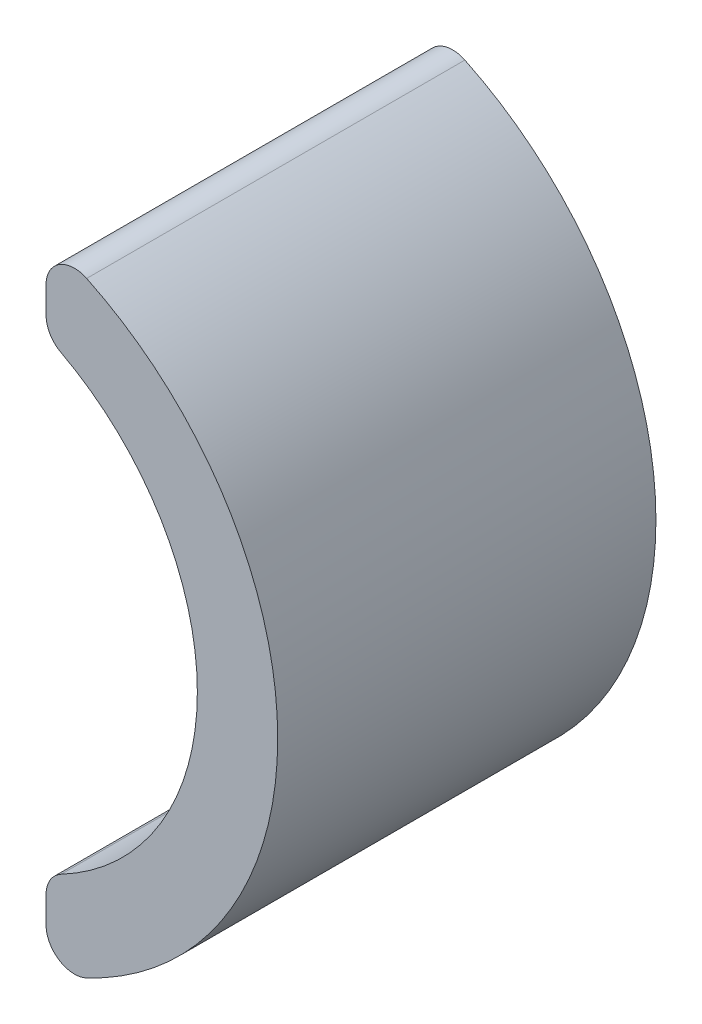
from build123d import *

# Parameters (mm, degrees)
ESQUISSE1_R             = 40
EXTRUSION1_DEPTH        = 93.5
ESQUISSE5_R             = 35.5
ENL_V_MAT_EXTRU_1_DEPTH = 132.345727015
EXTRUSION2_DEPTH        = 40
ESQUISSE7_R             = 39.999999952
ENL_V_MAT_EXTRU_2_DEPTH = 128.017557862


with BuildPart() as part:
    # Esquisse1 → Extrusion1 (new body)
    with BuildSketch(Plane.XY):
        with Locations((4.8e-08, -36.100000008)):
            Circle(ESQUISSE1_R)
    extrude(amount=EXTRUSION1_DEPTH)

    # Esquisse5 → Enl_v. mat.-Extru.1 (cut, through all)
    with BuildSketch(Plane(origin=(0, 0, -5.8), x_dir=(-1, 0, 0), z_dir=(0, 0, -1))):
        with Locations((0, -36.1)):
            Circle(ESQUISSE5_R)
    extrude(amount=-ENL_V_MAT_EXTRU_1_DEPTH, mode=Mode.SUBTRACT)

    # Esquisse6 → Extrusion2 (add)
    with BuildSketch(Plane(origin=(0, 0, 18.5), x_dir=(-1, 0, 0), z_dir=(0, 0, -1))):
        with BuildLine():
            Line((11, -62.632998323), (11, -65.430018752))
            ThreePointArc((11, -65.430018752), (12.399519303, -67.967431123), (15.292307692, -68.137405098))
            ThreePointArc((15.292307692, -68.137405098), (35.5, -36.1), (15.292307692, -4.062594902))
            ThreePointArc((15.292307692, -4.062594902), (12.399519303, -4.232568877), (11, -6.769981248))
            Line((11, -6.769981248), (11, -9.567001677))
            ThreePointArc((11, -9.567001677), (11.430953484, -11.116195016), (12.6, -12.220301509))
            ThreePointArc((12.6, -12.220301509), (27, -36.1), (12.6, -59.979698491))
            ThreePointArc((12.6, -59.979698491), (11.430953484, -61.083804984), (11, -62.632998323))
        make_face()
        with BuildLine():
            Line((-11, -62.632998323), (-11, -65.430018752))
            ThreePointArc((-11, -65.430018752), (-12.399519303, -67.967431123), (-15.292307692, -68.137405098))
            ThreePointArc((-15.292307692, -68.137405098), (-35.5, -36.1), (-15.292307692, -4.062594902))
            ThreePointArc((-15.292307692, -4.062594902), (-12.399519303, -4.232568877), (-11, -6.769981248))
            Line((-11, -6.769981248), (-11, -9.567001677))
            ThreePointArc((-11, -9.567001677), (-11.430953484, -11.116195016), (-12.6, -12.220301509))
            ThreePointArc((-12.6, -12.220301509), (-27, -36.1), (-12.6, -59.979698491))
            ThreePointArc((-12.6, -59.979698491), (-11.430953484, -61.083804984), (-11, -62.632998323))
        make_face()
    extrude(amount=-EXTRUSION2_DEPTH)

    # Esquisse7 → Enl_v. mat.-Extru.2 (cut, through all)
    with BuildSketch(Plane(origin=(0, 0, 0), x_dir=(-1, 0, 0), z_dir=(0, 0, -1))):
        with Locations((0, -36.1)):
            Circle(ESQUISSE7_R)
        with BuildLine():
            Line((11, -62.632998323), (11, -65.430018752))
            ThreePointArc((11, -65.430018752), (12.399519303, -67.967431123), (15.292307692, -68.137405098))
            ThreePointArc((15.292307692, -68.137405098), (-35.5, -36.1), (15.292307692, -4.062594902))
            ThreePointArc((15.292307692, -4.062594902), (12.399519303, -4.232568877), (11, -6.769981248))
            Line((11, -6.769981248), (11, -9.567001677))
            ThreePointArc((11, -9.567001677), (11.430953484, -11.116195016), (12.6, -12.220301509))
            ThreePointArc((12.6, -12.220301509), (27, -36.1), (12.6, -59.979698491))
            ThreePointArc((12.6, -59.979698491), (11.430953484, -61.083804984), (11, -62.632998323))
        make_face(mode=Mode.SUBTRACT)
    extrude(amount=-ENL_V_MAT_EXTRU_2_DEPTH, mode=Mode.SUBTRACT)


solid = part.part
